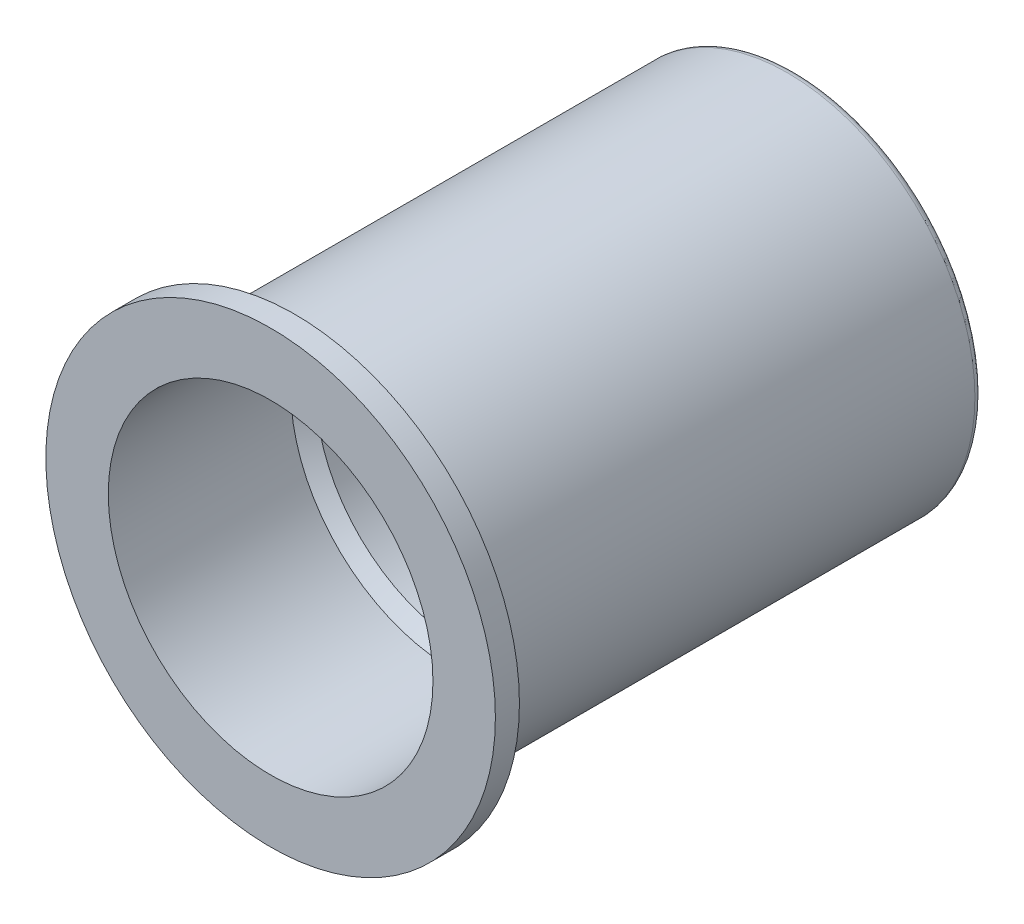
ISO-10303-21;
HEADER;
FILE_DESCRIPTION(('STEP AP214'),'2;1');
FILE_NAME('part.step','',(''),(''),'','','');
FILE_SCHEMA(('AUTOMOTIVE_DESIGN { 1 0 10303 214 1 1 1 1 }'));
ENDSEC;
DATA;
#1=APPLICATION_CONTEXT('core data for automotive mechanical design processes');
#2=APPLICATION_PROTOCOL_DEFINITION('international standard','automotive_design',2000,#1);
#3=PRODUCT_CONTEXT('',#1,'mechanical');
#4=PRODUCT('Part','Part','',(#3));
#5=PRODUCT_RELATED_PRODUCT_CATEGORY('part','',(#4));
#6=PRODUCT_DEFINITION_FORMATION('','',#4);
#7=PRODUCT_DEFINITION_CONTEXT('part definition',#1,'design');
#8=PRODUCT_DEFINITION('design','',#6,#7);
#9=PRODUCT_DEFINITION_SHAPE('','',#8);
#10=(LENGTH_UNIT() NAMED_UNIT(*) SI_UNIT(.MILLI.,.METRE.));
#11=(NAMED_UNIT(*) PLANE_ANGLE_UNIT() SI_UNIT($,.RADIAN.));
#12=(NAMED_UNIT(*) SI_UNIT($,.STERADIAN.) SOLID_ANGLE_UNIT());
#13=UNCERTAINTY_MEASURE_WITH_UNIT(LENGTH_MEASURE(1.E-05),#10,'distance_accuracy_value','');
#14=(GEOMETRIC_REPRESENTATION_CONTEXT(3) GLOBAL_UNCERTAINTY_ASSIGNED_CONTEXT((#13)) GLOBAL_UNIT_ASSIGNED_CONTEXT((#10,
#11,#12)) REPRESENTATION_CONTEXT('',''));
#15=CARTESIAN_POINT('',(0.,0.,0.));
#16=DIRECTION('',(0.,0.,1.));
#17=DIRECTION('',(1.,0.,0.));
#18=AXIS2_PLACEMENT_3D('',#15,#16,#17);
#19=CARTESIAN_POINT('',(0.,0.,-21.0000000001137));
#20=DIRECTION('',(0.,0.,1.));
#21=DIRECTION('',(1.,0.,0.));
#22=AXIS2_PLACEMENT_3D('',#19,#20,#21);
#23=CYLINDRICAL_SURFACE('',#22,7.5);
#24=CARTESIAN_POINT('',(0.,0.,-20.7000000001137));
#25=DIRECTION('',(0.,0.,-1.));
#26=DIRECTION('',(-1.,0.,0.));
#27=AXIS2_PLACEMENT_3D('',#24,#25,#26);
#28=CIRCLE('',#27,7.5);
#29=CARTESIAN_POINT('',(7.5,0.,-20.7000000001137));
#30=VERTEX_POINT('',#29);
#31=EDGE_CURVE('E53',#30,#30,#28,.F.);
#32=CARTESIAN_POINT('',(0.,0.,-1.8));
#33=DIRECTION('',(0.,0.,1.));
#34=DIRECTION('',(1.,0.,0.));
#35=AXIS2_PLACEMENT_3D('',#32,#33,#34);
#36=CIRCLE('',#35,7.5);
#37=CARTESIAN_POINT('',(7.5,0.,-1.8));
#38=VERTEX_POINT('',#37);
#39=EDGE_CURVE('E59',#38,#38,#36,.F.);
#40=CARTESIAN_POINT('',(7.5,0.,-20.7000000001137));
#41=CARTESIAN_POINT('',(7.5,0.,-20.5031250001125));
#42=CARTESIAN_POINT('',(7.5,0.,-20.3062500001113));
#43=CARTESIAN_POINT('',(7.5,0.,-19.9125000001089));
#44=CARTESIAN_POINT('',(7.5,0.,-19.7156250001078));
#45=CARTESIAN_POINT('',(7.5,0.,-19.3218750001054));
#46=CARTESIAN_POINT('',(7.5,0.,-19.1250000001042));
#47=CARTESIAN_POINT('',(7.5,0.,-18.7312500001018));
#48=CARTESIAN_POINT('',(7.5,0.,-18.5343750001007));
#49=CARTESIAN_POINT('',(7.5,0.,-18.1406250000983));
#50=CARTESIAN_POINT('',(7.5,0.,-17.9437500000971));
#51=CARTESIAN_POINT('',(7.5,0.,-17.5500000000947));
#52=CARTESIAN_POINT('',(7.5,0.,-17.3531250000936));
#53=CARTESIAN_POINT('',(7.5,0.,-16.9593750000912));
#54=CARTESIAN_POINT('',(7.5,0.,-16.76250000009));
#55=CARTESIAN_POINT('',(7.5,0.,-16.3687500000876));
#56=CARTESIAN_POINT('',(7.5,0.,-16.1718750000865));
#57=CARTESIAN_POINT('',(7.5,0.,-15.7781250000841));
#58=CARTESIAN_POINT('',(7.5,0.,-15.5812500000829));
#59=CARTESIAN_POINT('',(7.5,0.,-15.1875000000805));
#60=CARTESIAN_POINT('',(7.5,0.,-14.9906250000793));
#61=CARTESIAN_POINT('',(7.5,0.,-14.596875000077));
#62=CARTESIAN_POINT('',(7.5,0.,-14.4000000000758));
#63=CARTESIAN_POINT('',(7.5,0.,-14.0062500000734));
#64=CARTESIAN_POINT('',(7.5,0.,-13.8093750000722));
#65=CARTESIAN_POINT('',(7.5,0.,-13.4156250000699));
#66=CARTESIAN_POINT('',(7.5,0.,-13.2187500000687));
#67=CARTESIAN_POINT('',(7.5,0.,-12.8250000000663));
#68=CARTESIAN_POINT('',(7.5,0.,-12.6281250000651));
#69=CARTESIAN_POINT('',(7.5,0.,-12.2343750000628));
#70=CARTESIAN_POINT('',(7.5,0.,-12.0375000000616));
#71=CARTESIAN_POINT('',(7.5,0.,-11.6437500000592));
#72=CARTESIAN_POINT('',(7.5,0.,-11.446875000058));
#73=CARTESIAN_POINT('',(7.5,0.,-11.0531250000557));
#74=CARTESIAN_POINT('',(7.5,0.,-10.8562500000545));
#75=CARTESIAN_POINT('',(7.5,0.,-10.4625000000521));
#76=CARTESIAN_POINT('',(7.5,0.,-10.2656250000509));
#77=CARTESIAN_POINT('',(7.5,0.,-9.87187500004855));
#78=CARTESIAN_POINT('',(7.5,0.,-9.67500000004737));
#79=CARTESIAN_POINT('',(7.5,0.,-9.281250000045));
#80=CARTESIAN_POINT('',(7.5,0.,-9.08437500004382));
#81=CARTESIAN_POINT('',(7.5,0.,-8.69062500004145));
#82=CARTESIAN_POINT('',(7.5,0.,-8.49375000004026));
#83=CARTESIAN_POINT('',(7.5,0.,-8.10000000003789));
#84=CARTESIAN_POINT('',(7.5,0.,-7.90312500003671));
#85=CARTESIAN_POINT('',(7.5,0.,-7.50937500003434));
#86=CARTESIAN_POINT('',(7.5,0.,-7.31250000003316));
#87=CARTESIAN_POINT('',(7.5,0.,-6.91875000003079));
#88=CARTESIAN_POINT('',(7.5,0.,-6.72187500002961));
#89=CARTESIAN_POINT('',(7.5,0.,-6.32812500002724));
#90=CARTESIAN_POINT('',(7.5,0.,-6.13125000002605));
#91=CARTESIAN_POINT('',(7.5,0.,-5.73750000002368));
#92=CARTESIAN_POINT('',(7.5,0.,-5.5406250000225));
#93=CARTESIAN_POINT('',(7.5,0.,-5.14687500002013));
#94=CARTESIAN_POINT('',(7.5,0.,-4.95000000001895));
#95=CARTESIAN_POINT('',(7.5,0.,-4.55625000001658));
#96=CARTESIAN_POINT('',(7.5,0.,-4.3593750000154));
#97=CARTESIAN_POINT('',(7.5,0.,-3.96562500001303));
#98=CARTESIAN_POINT('',(7.5,0.,-3.76875000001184));
#99=CARTESIAN_POINT('',(7.5,0.,-3.37500000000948));
#100=CARTESIAN_POINT('',(7.5,0.,-3.17812500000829));
#101=CARTESIAN_POINT('',(7.5,0.,-2.78437500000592));
#102=CARTESIAN_POINT('',(7.5,0.,-2.58750000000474));
#103=CARTESIAN_POINT('',(7.5,0.,-2.19375000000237));
#104=CARTESIAN_POINT('',(7.5,0.,-1.99687500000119));
#105=CARTESIAN_POINT('',(7.5,0.,-1.8));
#106=B_SPLINE_CURVE_WITH_KNOTS('',3,(#40,#41,#42,#43,#44,#45,#46,#47,#48,#49,#50,#51,#52,#53,
#54,#55,#56,#57,#58,#59,#60,#61,#62,#63,#64,#65,#66,#67,#68,#69,#70,#71,#72,#73,#74,#75,#76,#77,
#78,#79,#80,#81,#82,#83,#84,#85,#86,#87,#88,#89,#90,#91,#92,#93,#94,#95,#96,#97,#98,#99,#100,
#101,#102,#103,#104,#105),.UNSPECIFIED.,.F.,.F.,(4,2,2,2,2,2,2,2,2,2,2,2,2,2,2,2,2,2,2,2,2,2,2,
2,2,2,2,2,2,2,2,2,4),(0.,0.590625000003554,1.18125000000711,1.77187500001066,2.36250000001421,
2.95312500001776,3.54375000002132,4.13437500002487,4.72500000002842,5.31562500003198,
5.90625000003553,6.49687500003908,7.08750000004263,7.67812500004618,8.26875000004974,
8.85937500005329,9.45000000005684,10.0406250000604,10.6312500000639,11.2218750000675,
11.8125000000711,12.4031250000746,12.9937500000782,13.5843750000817,14.1750000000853,
14.7656250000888,15.3562500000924,15.9468750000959,16.5375000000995,17.128125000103,
17.7187500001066,18.3093750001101,18.9000000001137),.UNSPECIFIED.);
#107=EDGE_CURVE('BSEAM33',#30,#38,#106,.T.);
#108=ORIENTED_EDGE('',*,*,#31,.T.);
#109=ORIENTED_EDGE('',*,*,#39,.T.);
#110=ORIENTED_EDGE('',*,*,#107,.T.);
#111=ORIENTED_EDGE('',*,*,#107,.F.);
#112=EDGE_LOOP('',(#108,#110,#109,#111));
#113=FACE_BOUND('',#112,.T.);
#114=ADVANCED_FACE('F33',(#113),#23,.T.);
#115=CARTESIAN_POINT('',(0.,0.,-21.0000000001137));
#116=DIRECTION('',(0.,0.,-1.));
#117=DIRECTION('',(-1.,0.,0.));
#118=AXIS2_PLACEMENT_3D('',#115,#116,#117);
#119=PLANE('',#118);
#120=CARTESIAN_POINT('',(0.,0.,-21.0000000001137));
#121=DIRECTION('',(0.,0.,-1.));
#122=DIRECTION('',(-1.,0.,0.));
#123=AXIS2_PLACEMENT_3D('',#120,#121,#122);
#124=CIRCLE('',#123,6.48);
#125=CARTESIAN_POINT('',(-6.48,0.,-21.0000000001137));
#126=VERTEX_POINT('',#125);
#127=EDGE_CURVE('E40',#126,#126,#124,.F.);
#128=ORIENTED_EDGE('',*,*,#127,.T.);
#129=EDGE_LOOP('',(#128));
#130=FACE_BOUND('',#129,.T.);
#131=CARTESIAN_POINT('',(0.,0.,-21.0000000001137));
#132=DIRECTION('',(0.,0.,-1.));
#133=DIRECTION('',(-1.,0.,0.));
#134=AXIS2_PLACEMENT_3D('',#131,#132,#133);
#135=CIRCLE('',#134,7.2);
#136=CARTESIAN_POINT('',(-7.2,0.,-21.0000000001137));
#137=VERTEX_POINT('',#136);
#138=EDGE_CURVE('E56',#137,#137,#135,.T.);
#139=ORIENTED_EDGE('',*,*,#138,.T.);
#140=EDGE_LOOP('',(#139));
#141=FACE_BOUND('',#140,.T.);
#142=ADVANCED_FACE('F99',(#130,#141),#119,.T.);
#143=CARTESIAN_POINT('',(0.,0.,-0.962842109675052));
#144=DIRECTION('',(0.,0.,1.));
#145=DIRECTION('',(1.,0.,0.));
#146=AXIS2_PLACEMENT_3D('',#143,#144,#145);
#147=CONICAL_SURFACE('',#146,9.,1.0471975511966);
#148=CARTESIAN_POINT('',(0.,0.,-1.76170274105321));
#149=DIRECTION('',(0.,0.,1.));
#150=DIRECTION('',(1.,0.,0.));
#151=AXIS2_PLACEMENT_3D('',#148,#149,#150);
#152=CIRCLE('',#151,7.61633279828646);
#153=CARTESIAN_POINT('',(7.61633279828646,0.,-1.76170274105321));
#154=VERTEX_POINT('',#153);
#155=EDGE_CURVE('E48',#154,#154,#152,.T.);
#156=ORIENTED_EDGE('',*,*,#155,.T.);
#157=EDGE_LOOP('',(#156));
#158=FACE_BOUND('',#157,.T.);
#159=CARTESIAN_POINT('',(0.,0.,-0.962842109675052));
#160=DIRECTION('',(0.,0.,1.));
#161=DIRECTION('',(1.,0.,0.));
#162=AXIS2_PLACEMENT_3D('',#159,#160,#161);
#163=CIRCLE('',#162,9.);
#164=CARTESIAN_POINT('',(9.,0.,-0.962842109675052));
#165=VERTEX_POINT('',#164);
#166=EDGE_CURVE('E63',#165,#165,#163,.T.);
#167=ORIENTED_EDGE('',*,*,#166,.F.);
#168=EDGE_LOOP('',(#167));
#169=FACE_BOUND('',#168,.T.);
#170=ADVANCED_FACE('F89',(#158,#169),#147,.T.);
#171=CARTESIAN_POINT('',(0.,0.,0.));
#172=DIRECTION('',(0.,0.,1.));
#173=DIRECTION('',(1.,0.,0.));
#174=AXIS2_PLACEMENT_3D('',#171,#172,#173);
#175=PLANE('',#174);
#176=CARTESIAN_POINT('',(0.,0.,5.6843418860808E-11));
#177=DIRECTION('',(0.,0.,1.));
#178=DIRECTION('',(1.,0.,0.));
#179=AXIS2_PLACEMENT_3D('',#176,#177,#178);
#180=CIRCLE('',#179,6.5);
#181=CARTESIAN_POINT('',(6.5,0.,5.6843418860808E-11));
#182=VERTEX_POINT('',#181);
#183=EDGE_CURVE('E69',#182,#182,#180,.T.);
#184=ORIENTED_EDGE('',*,*,#183,.F.);
#185=EDGE_LOOP('',(#184));
#186=FACE_BOUND('',#185,.T.);
#187=CARTESIAN_POINT('',(0.,0.,0.));
#188=DIRECTION('',(0.,0.,1.));
#189=DIRECTION('',(1.,0.,0.));
#190=AXIS2_PLACEMENT_3D('',#187,#188,#189);
#191=CIRCLE('',#190,9.);
#192=CARTESIAN_POINT('',(9.,0.,0.));
#193=VERTEX_POINT('',#192);
#194=EDGE_CURVE('E60',#193,#193,#191,.T.);
#195=ORIENTED_EDGE('',*,*,#194,.T.);
#196=EDGE_LOOP('',(#195));
#197=FACE_BOUND('',#196,.T.);
#198=ADVANCED_FACE('F86',(#186,#197),#175,.T.);
#199=CARTESIAN_POINT('',(0.,0.,-1.8));
#200=DIRECTION('',(0.,0.,1.));
#201=DIRECTION('',(1.,0.,0.));
#202=AXIS2_PLACEMENT_3D('',#199,#200,#201);
#203=CYLINDRICAL_SURFACE('',#202,9.);
#204=ORIENTED_EDGE('',*,*,#194,.F.);
#205=EDGE_LOOP('',(#204));
#206=FACE_BOUND('',#205,.T.);
#207=ORIENTED_EDGE('',*,*,#166,.T.);
#208=EDGE_LOOP('',(#207));
#209=FACE_BOUND('',#208,.T.);
#210=ADVANCED_FACE('F82',(#206,#209),#203,.T.);
#211=CARTESIAN_POINT('',(0.,0.,-7.29999999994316));
#212=DIRECTION('',(0.,0.,1.));
#213=DIRECTION('',(1.,0.,0.));
#214=AXIS2_PLACEMENT_3D('',#211,#212,#213);
#215=CYLINDRICAL_SURFACE('',#214,6.5);
#216=CARTESIAN_POINT('',(0.,0.,-7.29999999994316));
#217=DIRECTION('',(0.,0.,1.));
#218=DIRECTION('',(1.,0.,0.));
#219=AXIS2_PLACEMENT_3D('',#216,#217,#218);
#220=CIRCLE('',#219,6.5);
#221=CARTESIAN_POINT('',(6.5,0.,-7.29999999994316));
#222=VERTEX_POINT('',#221);
#223=EDGE_CURVE('E68',#222,#222,#220,.T.);
#224=ORIENTED_EDGE('',*,*,#223,.F.);
#225=EDGE_LOOP('',(#224));
#226=FACE_BOUND('',#225,.T.);
#227=ORIENTED_EDGE('',*,*,#183,.T.);
#228=EDGE_LOOP('',(#227));
#229=FACE_BOUND('',#228,.T.);
#230=ADVANCED_FACE('F78',(#226,#229),#215,.F.);
#231=CARTESIAN_POINT('',(0.,0.,-21.0000000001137));
#232=DIRECTION('',(0.,0.,1.));
#233=DIRECTION('',(1.,0.,0.));
#234=AXIS2_PLACEMENT_3D('',#231,#232,#233);
#235=CYLINDRICAL_SURFACE('',#234,6.);
#236=CARTESIAN_POINT('',(0.,0.,-20.5200000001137));
#237=DIRECTION('',(0.,0.,-1.));
#238=DIRECTION('',(-1.,0.,0.));
#239=AXIS2_PLACEMENT_3D('',#236,#237,#238);
#240=CIRCLE('',#239,6.);
#241=CARTESIAN_POINT('',(-6.,0.,-20.5200000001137));
#242=VERTEX_POINT('',#241);
#243=EDGE_CURVE('E10',#242,#242,#240,.T.);
#244=ORIENTED_EDGE('',*,*,#243,.T.);
#245=EDGE_LOOP('',(#244));
#246=FACE_BOUND('',#245,.T.);
#247=CARTESIAN_POINT('',(0.,0.,-7.80000000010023));
#248=DIRECTION('',(0.,0.,1.));
#249=DIRECTION('',(1.,0.,0.));
#250=AXIS2_PLACEMENT_3D('',#247,#248,#249);
#251=CIRCLE('',#250,6.);
#252=CARTESIAN_POINT('',(6.,0.,-7.80000000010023));
#253=VERTEX_POINT('',#252);
#254=EDGE_CURVE('E44',#253,#253,#251,.T.);
#255=ORIENTED_EDGE('',*,*,#254,.T.);
#256=EDGE_LOOP('',(#255));
#257=FACE_BOUND('',#256,.T.);
#258=ADVANCED_FACE('F81',(#246,#257),#235,.F.);
#259=CARTESIAN_POINT('',(0.,0.,-20.7000000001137));
#260=DIRECTION('',(0.,0.,-1.));
#261=DIRECTION('',(-1.,0.,0.));
#262=AXIS2_PLACEMENT_3D('',#259,#260,#261);
#263=TOROIDAL_SURFACE('',#262,7.2,0.3);
#264=ORIENTED_EDGE('',*,*,#31,.F.);
#265=EDGE_LOOP('',(#264));
#266=FACE_BOUND('',#265,.T.);
#267=ORIENTED_EDGE('',*,*,#138,.F.);
#268=EDGE_LOOP('',(#267));
#269=FACE_BOUND('',#268,.T.);
#270=ADVANCED_FACE('F113',(#266,#269),#263,.T.);
#271=CARTESIAN_POINT('',(0.,0.,-1.50189511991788));
#272=DIRECTION('',(0.,0.,-1.));
#273=DIRECTION('',(-1.,0.,0.));
#274=AXIS2_PLACEMENT_3D('',#271,#272,#273);
#275=TOROIDAL_SURFACE('',#274,7.46633279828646,0.3);
#276=ORIENTED_EDGE('',*,*,#39,.F.);
#277=EDGE_LOOP('',(#276));
#278=FACE_BOUND('',#277,.T.);
#279=ORIENTED_EDGE('',*,*,#155,.F.);
#280=EDGE_LOOP('',(#279));
#281=FACE_BOUND('',#280,.T.);
#282=ADVANCED_FACE('F116',(#278,#281),#275,.T.);
#283=CARTESIAN_POINT('',(0.,0.,-7.80000000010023));
#284=DIRECTION('',(0.,0.,1.));
#285=DIRECTION('',(1.,0.,0.));
#286=AXIS2_PLACEMENT_3D('',#283,#284,#285);
#287=CONICAL_SURFACE('',#286,6.,0.78539816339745);
#288=ORIENTED_EDGE('',*,*,#223,.T.);
#289=EDGE_LOOP('',(#288));
#290=FACE_BOUND('',#289,.T.);
#291=ORIENTED_EDGE('',*,*,#254,.F.);
#292=EDGE_LOOP('',(#291));
#293=FACE_BOUND('',#292,.T.);
#294=ADVANCED_FACE('F75',(#290,#293),#287,.F.);
#295=CARTESIAN_POINT('',(0.,0.,-21.0000000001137));
#296=DIRECTION('',(0.,0.,-1.));
#297=DIRECTION('',(-1.,0.,0.));
#298=AXIS2_PLACEMENT_3D('',#295,#296,#297);
#299=CONICAL_SURFACE('',#298,6.48,0.785398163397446);
#300=ORIENTED_EDGE('',*,*,#243,.F.);
#301=EDGE_LOOP('',(#300));
#302=FACE_BOUND('',#301,.T.);
#303=ORIENTED_EDGE('',*,*,#127,.F.);
#304=EDGE_LOOP('',(#303));
#305=FACE_BOUND('',#304,.T.);
#306=ADVANCED_FACE('F35',(#302,#305),#299,.F.);
#307=CLOSED_SHELL('',(#114,#142,#170,#198,#210,#230,#258,#270,#282,#294,#306));
#308=MANIFOLD_SOLID_BREP('B2',#307);
#309=ADVANCED_BREP_SHAPE_REPRESENTATION('',(#18,#308),#14);
#310=SHAPE_DEFINITION_REPRESENTATION(#9,#309);
ENDSEC;
END-ISO-10303-21;
